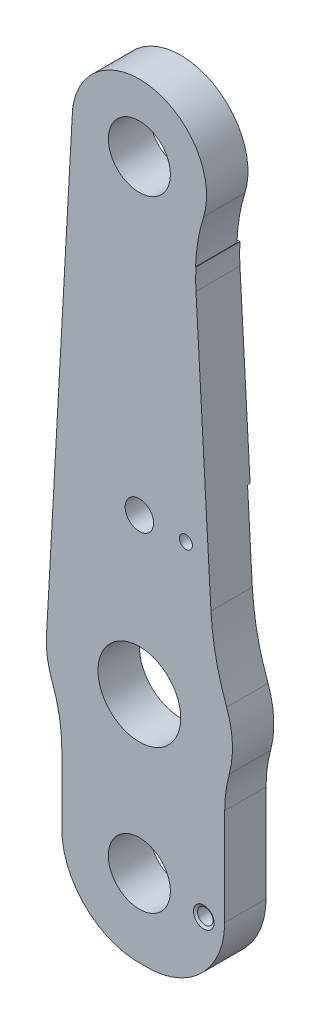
from build123d import *

# Parameters (mm, degrees)
ESQUISSE1_R             = 5.5
ESQUISSE1_R_2           = 12
BASE_EXTRUSION_DEPTH    = 16
BOSS_EXTRU_1_DEPTH      = 17
ESQUISSE5_R             = 3
ENL_V_MAT_EXTRU_3_DEPTH = 10
CHANFREIN2_SIZE         = 1
CHANFREIN2_SIZE2        = 0.577350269
ESQUISSE7_R             = 16
ENL_V_MAT_EXTRU_4_DEPTH = 273.919402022
ESQUISSE8_R             = 2.5
ENL_V_MAT_EXTRU_5_DEPTH = 273.919402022


with BuildPart() as part:
    # Esquisse1 → Base-Extrusion (new body)
    with BuildSketch(Plane.XY):
        with BuildLine():
            Line((21.796120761, -32.33017369), (27.683346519, -138.300237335))
            ThreePointArc((27.683346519, -138.300237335), (29.626321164, -153.124556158), (33.757777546, -167.493503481))
            ThreePointArc((33.757777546, -167.493503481), (35.963644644, -178.382513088), (34.744186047, -189.425578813))
            ThreePointArc((34.744186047, -189.425578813), (33.437964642, -195.913278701), (33, -202.516660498))
            Line((33, -202.516660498), (33, -240))
            ThreePointArc((33, -240), (23.676073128, -261.737065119), (1.5, -269.962476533))
            ThreePointArc((1.5, -269.962476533), (-20.676073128, -261.737065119), (-30, -240))
            Line((-30, -240), (-30, -213.406586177))
            ThreePointArc((-30, -213.406586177), (-30.944940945, -202.799984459), (-33.75, -192.527469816))
            ThreePointArc((-33.75, -192.527469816), (-35.731490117, -184.388691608), (-35.778461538, -176.012307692))
            Line((-35.778461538, -176.012307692), (-26, 0))
            ThreePointArc((-26, 0), (3.89623112, 25.706407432), (24.832260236, -7.704469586))
            ThreePointArc((24.832260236, -7.704469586), (22.214383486, -19.881724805), (21.796120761, -32.33017369))
        make_face()
        with Locations((0, -120)):
            Circle(ESQUISSE1_R, mode=Mode.SUBTRACT)
        Circle(ESQUISSE1_R_2, mode=Mode.SUBTRACT)
        with Locations((0, -240)):
            Circle(ESQUISSE1_R_2, mode=Mode.SUBTRACT)
    extrude(amount=BASE_EXTRUSION_DEPTH)

    # Esquisse2 → Boss.-Extru.1 (add)
    with BuildSketch(Plane.XY.offset(16)):
        with BuildLine():
            Line((-27.444444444, -26), (21.918077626, -26))
            ThreePointArc((21.918077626, -26), (21.788955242, -30.068042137), (21.896484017, -34.13671231))
            Line((21.896484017, -34.13671231), (25.833333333, -105))
            Line((25.833333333, -105), (-31.833333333, -105))
            Line((-31.833333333, -105), (-27.444444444, -26))
        make_face()
    extrude(amount=-BOSS_EXTRU_1_DEPTH)

    # Esquisse5 → Enl_v. mat.-Extru.3 (cut)
    with BuildSketch(Plane.XY.offset(16)):
        with Locations((24.904867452, -242.178893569)):
            Circle(ESQUISSE5_R)
    extrude(amount=-ENL_V_MAT_EXTRU_3_DEPTH, mode=Mode.SUBTRACT)

    # Esquisse6 → Enl_vement de mati_re-R_volution1 (revolve, cut)
    with BuildSketch(Plane(origin=(25, 0, 0), x_dir=(0, 0, -1), z_dir=(1, 0, 0)), mode=Mode.PRIVATE) as enl_vement_de_mati_re_r_volution1_sk:
        Polygon((-6, -239.178893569), (-3.482701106, -242.178893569), (-6, -242.178893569), align=None)
    revolve(enl_vement_de_mati_re_r_volution1_sk.sketch.rotate(Axis((25, -242.178893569, -2.771145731), (0, 0, 1)), 270), axis=Axis((25, -242.178893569, -2.771145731), (0, 0, 1)), mode=Mode.SUBTRACT)

    # Chanfrein2
    chanfrein2_edges = [part.edges().sort_by_distance(p)[0] for p in [
        (21.904867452, -242.178893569, 16),
    ]]
    chanfrein2_side = [part.faces().sort_by_distance(p)[0] for p in [
        (-1.244662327, -129.817843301, 16),
    ]]
    chamfer(chanfrein2_edges, length=CHANFREIN2_SIZE, length2=CHANFREIN2_SIZE2, reference=chanfrein2_side[0])

    # Esquisse7 → Enl_v. mat.-Extru.4 (cut, through all)
    with BuildSketch(Plane.XY.offset(16)):
        with Locations((0, -180)):
            Circle(ESQUISSE7_R)
    extrude(amount=-ENL_V_MAT_EXTRU_4_DEPTH, mode=Mode.SUBTRACT)

    # Esquisse8 → Enl_v. mat.-Extru.5 (cut, through all)
    with BuildSketch(Plane.XY.offset(16)):
        with Locations((18, -120)):
            Circle(ESQUISSE8_R)
    extrude(amount=-ENL_V_MAT_EXTRU_5_DEPTH, mode=Mode.SUBTRACT)


solid = part.part
